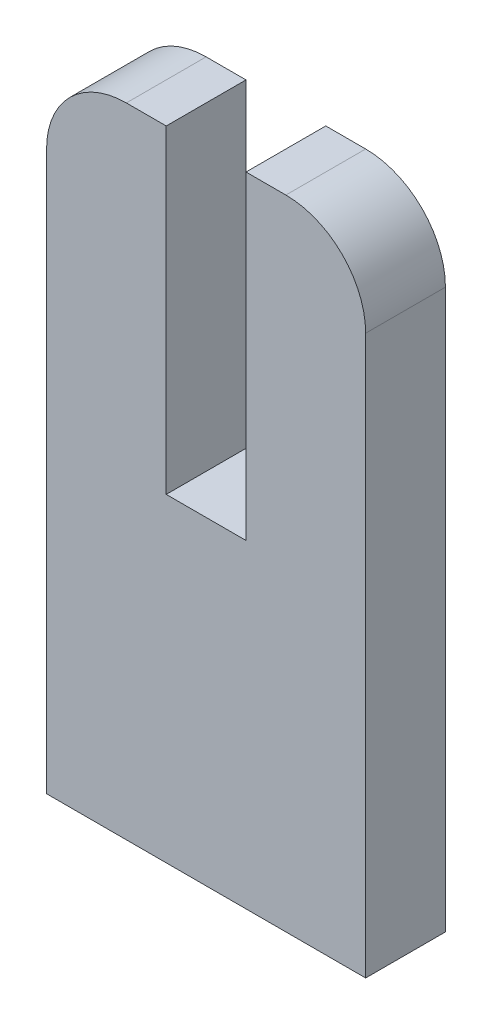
from build123d import *

# Parameters (mm, degrees)
SKETCH1_W           = 12.7
SKETCH1_H           = 25.4
BOSS_EXTRUDE1_DEPTH = 1.5875
SKETCH2_W           = 3.175
SKETCH2_H           = 12.7
CUT_EXTRUDE1_DEPTH  = 15.549677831
FILLET1_R           = 3.175


with BuildPart() as part:
    # Sketch1 → Boss-Extrude1 (new, symmetric)
    with BuildSketch(Plane.XY):
        Rectangle(SKETCH1_W, SKETCH1_H)
    extrude(amount=BOSS_EXTRUDE1_DEPTH, both=True)

    # Sketch2 → Cut-Extrude1 (cut, through all)
    with BuildSketch(Plane.XY.offset(1.5875)):
        with Locations((0, 6.35)):
            Rectangle(SKETCH2_W, SKETCH2_H)
    extrude(amount=-CUT_EXTRUDE1_DEPTH, mode=Mode.SUBTRACT)

    # Fillet1
    fillet1_edges = [part.edges().sort_by_distance(p)[0] for p in [
        (-6.35, 12.7, 0),
        (6.35, 12.7, 0),
    ]]
    fillet(fillet1_edges, radius=FILLET1_R)


solid = part.part
